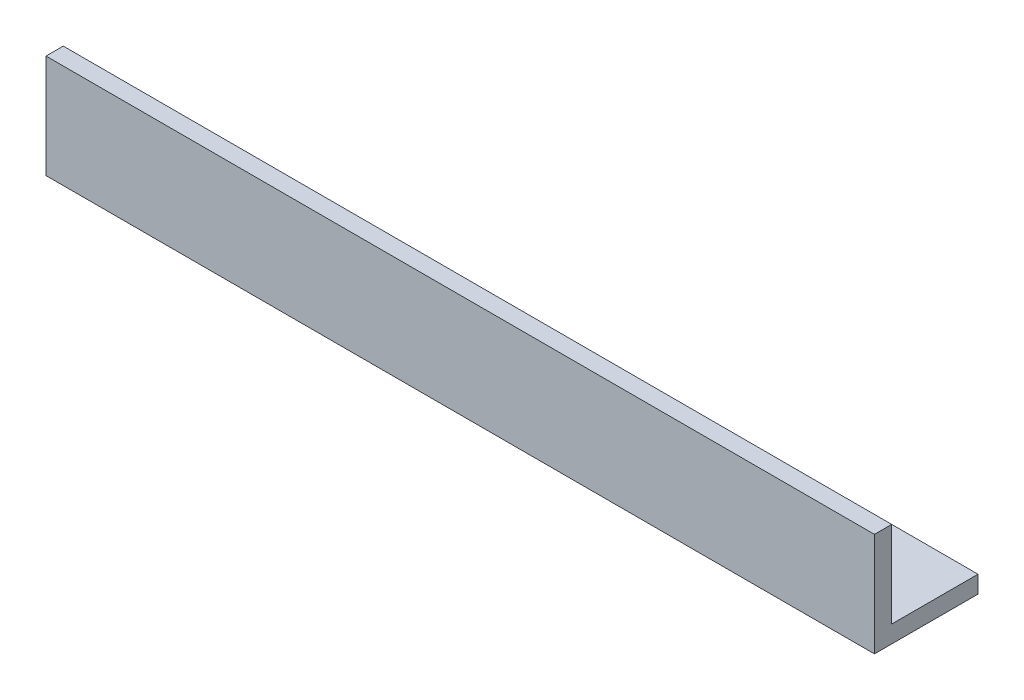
ISO-10303-21;
HEADER;
FILE_DESCRIPTION(('STEP AP214'),'2;1');
FILE_NAME('part.step','',(''),(''),'','','');
FILE_SCHEMA(('AUTOMOTIVE_DESIGN { 1 0 10303 214 1 1 1 1 }'));
ENDSEC;
DATA;
#1=APPLICATION_CONTEXT('core data for automotive mechanical design processes');
#2=APPLICATION_PROTOCOL_DEFINITION('international standard','automotive_design',2000,#1);
#3=PRODUCT_CONTEXT('',#1,'mechanical');
#4=PRODUCT('Part','Part','',(#3));
#5=PRODUCT_RELATED_PRODUCT_CATEGORY('part','',(#4));
#6=PRODUCT_DEFINITION_FORMATION('','',#4);
#7=PRODUCT_DEFINITION_CONTEXT('part definition',#1,'design');
#8=PRODUCT_DEFINITION('design','',#6,#7);
#9=PRODUCT_DEFINITION_SHAPE('','',#8);
#10=(LENGTH_UNIT() NAMED_UNIT(*) SI_UNIT(.MILLI.,.METRE.));
#11=(NAMED_UNIT(*) PLANE_ANGLE_UNIT() SI_UNIT($,.RADIAN.));
#12=(NAMED_UNIT(*) SI_UNIT($,.STERADIAN.) SOLID_ANGLE_UNIT());
#13=UNCERTAINTY_MEASURE_WITH_UNIT(LENGTH_MEASURE(1.E-05),#10,'distance_accuracy_value','');
#14=(GEOMETRIC_REPRESENTATION_CONTEXT(3) GLOBAL_UNCERTAINTY_ASSIGNED_CONTEXT((#13)) GLOBAL_UNIT_ASSIGNED_CONTEXT((#10,
#11,#12)) REPRESENTATION_CONTEXT('',''));
#15=CARTESIAN_POINT('',(0.,0.,0.));
#16=DIRECTION('',(0.,0.,1.));
#17=DIRECTION('',(1.,0.,0.));
#18=AXIS2_PLACEMENT_3D('',#15,#16,#17);
#19=CARTESIAN_POINT('',(304.8,0.,0.));
#20=DIRECTION('',(0.,1.,0.));
#21=DIRECTION('',(0.,0.,1.));
#22=AXIS2_PLACEMENT_3D('',#19,#20,#21);
#23=PLANE('',#22);
#24=DIRECTION('',(0.,0.,-1.));
#25=VECTOR('',#24,1.);
#26=CARTESIAN_POINT('',(0.,0.,0.));
#27=LINE('',#26,#25);
#28=CARTESIAN_POINT('',(0.,0.,0.));
#29=VERTEX_POINT('',#28);
#30=CARTESIAN_POINT('',(0.,0.,-38.1));
#31=VERTEX_POINT('',#30);
#32=EDGE_CURVE('E117',#29,#31,#27,.T.);
#33=ORIENTED_EDGE('',*,*,#32,.T.);
#34=DIRECTION('',(-1.,0.,0.));
#35=VECTOR('',#34,1.);
#36=CARTESIAN_POINT('',(304.8,0.,-38.1));
#37=LINE('',#36,#35);
#38=CARTESIAN_POINT('',(304.8,0.,-38.1));
#39=VERTEX_POINT('',#38);
#40=EDGE_CURVE('E11',#39,#31,#37,.T.);
#41=ORIENTED_EDGE('',*,*,#40,.F.);
#42=DIRECTION('',(0.,0.,-1.));
#43=VECTOR('',#42,1.);
#44=CARTESIAN_POINT('',(304.8,0.,0.));
#45=LINE('',#44,#43);
#46=CARTESIAN_POINT('',(304.8,0.,0.));
#47=VERTEX_POINT('',#46);
#48=EDGE_CURVE('E127',#47,#39,#45,.T.);
#49=ORIENTED_EDGE('',*,*,#48,.F.);
#50=DIRECTION('',(-1.,0.,0.));
#51=VECTOR('',#50,1.);
#52=CARTESIAN_POINT('',(304.8,0.,0.));
#53=LINE('',#52,#51);
#54=EDGE_CURVE('E113',#47,#29,#53,.T.);
#55=ORIENTED_EDGE('',*,*,#54,.T.);
#56=EDGE_LOOP('',(#33,#41,#49,#55));
#57=FACE_BOUND('',#56,.T.);
#58=ADVANCED_FACE('F33',(#57),#23,.F.);
#59=CARTESIAN_POINT('',(304.8,0.,-38.1));
#60=DIRECTION('',(0.,0.,1.));
#61=DIRECTION('',(1.,0.,0.));
#62=AXIS2_PLACEMENT_3D('',#59,#60,#61);
#63=PLANE('',#62);
#64=DIRECTION('',(0.,1.,0.));
#65=VECTOR('',#64,1.);
#66=CARTESIAN_POINT('',(0.,0.,-38.1));
#67=LINE('',#66,#65);
#68=CARTESIAN_POINT('',(0.,6.35,-38.1));
#69=VERTEX_POINT('',#68);
#70=EDGE_CURVE('E120',#31,#69,#67,.T.);
#71=ORIENTED_EDGE('',*,*,#70,.T.);
#72=DIRECTION('',(-1.,0.,0.));
#73=VECTOR('',#72,1.);
#74=CARTESIAN_POINT('',(304.8,6.35,-38.1));
#75=LINE('',#74,#73);
#76=CARTESIAN_POINT('',(304.8,6.35,-38.1));
#77=VERTEX_POINT('',#76);
#78=EDGE_CURVE('E41',#77,#69,#75,.T.);
#79=ORIENTED_EDGE('',*,*,#78,.F.);
#80=DIRECTION('',(0.,1.,0.));
#81=VECTOR('',#80,1.);
#82=CARTESIAN_POINT('',(304.8,0.,-38.1));
#83=LINE('',#82,#81);
#84=EDGE_CURVE('E86',#39,#77,#83,.T.);
#85=ORIENTED_EDGE('',*,*,#84,.F.);
#86=ORIENTED_EDGE('',*,*,#40,.T.);
#87=EDGE_LOOP('',(#71,#79,#85,#86));
#88=FACE_BOUND('',#87,.T.);
#89=ADVANCED_FACE('F151',(#88),#63,.F.);
#90=CARTESIAN_POINT('',(304.8,6.35,-38.1));
#91=DIRECTION('',(0.,-1.,0.));
#92=DIRECTION('',(0.,0.,-1.));
#93=AXIS2_PLACEMENT_3D('',#90,#91,#92);
#94=PLANE('',#93);
#95=DIRECTION('',(0.,0.,1.));
#96=VECTOR('',#95,1.);
#97=CARTESIAN_POINT('',(0.,6.35,-38.1));
#98=LINE('',#97,#96);
#99=CARTESIAN_POINT('',(0.,6.35,-6.35000000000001));
#100=VERTEX_POINT('',#99);
#101=EDGE_CURVE('E122',#69,#100,#98,.T.);
#102=ORIENTED_EDGE('',*,*,#101,.T.);
#103=DIRECTION('',(-1.,0.,0.));
#104=VECTOR('',#103,1.);
#105=CARTESIAN_POINT('',(304.8,6.35,-6.35000000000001));
#106=LINE('',#105,#104);
#107=CARTESIAN_POINT('',(304.8,6.35,-6.35000000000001));
#108=VERTEX_POINT('',#107);
#109=EDGE_CURVE('E108',#108,#100,#106,.T.);
#110=ORIENTED_EDGE('',*,*,#109,.F.);
#111=DIRECTION('',(0.,0.,1.));
#112=VECTOR('',#111,1.);
#113=CARTESIAN_POINT('',(304.8,6.35,-38.1));
#114=LINE('',#113,#112);
#115=EDGE_CURVE('E99',#77,#108,#114,.T.);
#116=ORIENTED_EDGE('',*,*,#115,.F.);
#117=ORIENTED_EDGE('',*,*,#78,.T.);
#118=EDGE_LOOP('',(#102,#110,#116,#117));
#119=FACE_BOUND('',#118,.T.);
#120=ADVANCED_FACE('F133',(#119),#94,.F.);
#121=CARTESIAN_POINT('',(304.8,38.1,-6.35));
#122=DIRECTION('',(0.,0.,1.));
#123=DIRECTION('',(0.,-1.,0.));
#124=AXIS2_PLACEMENT_3D('',#121,#122,#123);
#125=PLANE('',#124);
#126=DIRECTION('',(0.,1.,0.));
#127=VECTOR('',#126,1.);
#128=CARTESIAN_POINT('',(0.,38.1,-6.35));
#129=LINE('',#128,#127);
#130=CARTESIAN_POINT('',(0.,38.1,-6.35));
#131=VERTEX_POINT('',#130);
#132=EDGE_CURVE('E107',#100,#131,#129,.T.);
#133=ORIENTED_EDGE('',*,*,#132,.T.);
#134=DIRECTION('',(-1.,0.,0.));
#135=VECTOR('',#134,1.);
#136=CARTESIAN_POINT('',(304.8,38.1,-6.35));
#137=LINE('',#136,#135);
#138=CARTESIAN_POINT('',(304.8,38.1,-6.35));
#139=VERTEX_POINT('',#138);
#140=EDGE_CURVE('E104',#139,#131,#137,.T.);
#141=ORIENTED_EDGE('',*,*,#140,.F.);
#142=DIRECTION('',(0.,1.,0.));
#143=VECTOR('',#142,1.);
#144=CARTESIAN_POINT('',(304.8,38.1,-6.35));
#145=LINE('',#144,#143);
#146=EDGE_CURVE('E93',#108,#139,#145,.T.);
#147=ORIENTED_EDGE('',*,*,#146,.F.);
#148=ORIENTED_EDGE('',*,*,#109,.T.);
#149=EDGE_LOOP('',(#133,#141,#147,#148));
#150=FACE_BOUND('',#149,.T.);
#151=ADVANCED_FACE('F105',(#150),#125,.F.);
#152=CARTESIAN_POINT('',(304.8,38.1,0.));
#153=DIRECTION('',(0.,-1.,0.));
#154=DIRECTION('',(0.,0.,-1.));
#155=AXIS2_PLACEMENT_3D('',#152,#153,#154);
#156=PLANE('',#155);
#157=DIRECTION('',(0.,0.,1.));
#158=VECTOR('',#157,1.);
#159=CARTESIAN_POINT('',(0.,38.1,0.));
#160=LINE('',#159,#158);
#161=CARTESIAN_POINT('',(0.,38.1,0.));
#162=VERTEX_POINT('',#161);
#163=EDGE_CURVE('E72',#131,#162,#160,.T.);
#164=ORIENTED_EDGE('',*,*,#163,.T.);
#165=DIRECTION('',(-1.,0.,0.));
#166=VECTOR('',#165,1.);
#167=CARTESIAN_POINT('',(304.8,38.1,0.));
#168=LINE('',#167,#166);
#169=CARTESIAN_POINT('',(304.8,38.1,0.));
#170=VERTEX_POINT('',#169);
#171=EDGE_CURVE('E109',#170,#162,#168,.T.);
#172=ORIENTED_EDGE('',*,*,#171,.F.);
#173=DIRECTION('',(0.,0.,1.));
#174=VECTOR('',#173,1.);
#175=CARTESIAN_POINT('',(304.8,38.1,0.));
#176=LINE('',#175,#174);
#177=EDGE_CURVE('E97',#139,#170,#176,.T.);
#178=ORIENTED_EDGE('',*,*,#177,.F.);
#179=ORIENTED_EDGE('',*,*,#140,.T.);
#180=EDGE_LOOP('',(#164,#172,#178,#179));
#181=FACE_BOUND('',#180,.T.);
#182=ADVANCED_FACE('F111',(#181),#156,.F.);
#183=CARTESIAN_POINT('',(304.8,0.,0.));
#184=DIRECTION('',(0.,0.,-1.));
#185=DIRECTION('',(-1.,0.,0.));
#186=AXIS2_PLACEMENT_3D('',#183,#184,#185);
#187=PLANE('',#186);
#188=DIRECTION('',(0.,-1.,0.));
#189=VECTOR('',#188,1.);
#190=CARTESIAN_POINT('',(0.,0.,0.));
#191=LINE('',#190,#189);
#192=EDGE_CURVE('E78',#162,#29,#191,.T.);
#193=ORIENTED_EDGE('',*,*,#192,.T.);
#194=ORIENTED_EDGE('',*,*,#54,.F.);
#195=DIRECTION('',(0.,-1.,0.));
#196=VECTOR('',#195,1.);
#197=CARTESIAN_POINT('',(304.8,0.,0.));
#198=LINE('',#197,#196);
#199=EDGE_CURVE('E49',#170,#47,#198,.T.);
#200=ORIENTED_EDGE('',*,*,#199,.F.);
#201=ORIENTED_EDGE('',*,*,#171,.T.);
#202=EDGE_LOOP('',(#193,#194,#200,#201));
#203=FACE_BOUND('',#202,.T.);
#204=ADVANCED_FACE('F140',(#203),#187,.F.);
#205=CARTESIAN_POINT('',(304.8,0.,0.));
#206=DIRECTION('',(1.,0.,0.));
#207=DIRECTION('',(0.,0.,-1.));
#208=AXIS2_PLACEMENT_3D('',#205,#206,#207);
#209=PLANE('',#208);
#210=ORIENTED_EDGE('',*,*,#48,.T.);
#211=ORIENTED_EDGE('',*,*,#84,.T.);
#212=ORIENTED_EDGE('',*,*,#115,.T.);
#213=ORIENTED_EDGE('',*,*,#146,.T.);
#214=ORIENTED_EDGE('',*,*,#177,.T.);
#215=ORIENTED_EDGE('',*,*,#199,.T.);
#216=EDGE_LOOP('',(#210,#211,#212,#213,#214,#215));
#217=FACE_BOUND('',#216,.T.);
#218=ADVANCED_FACE('F95',(#217),#209,.T.);
#219=CARTESIAN_POINT('',(0.,0.,0.));
#220=DIRECTION('',(1.,0.,0.));
#221=DIRECTION('',(0.,0.,-1.));
#222=AXIS2_PLACEMENT_3D('',#219,#220,#221);
#223=PLANE('',#222);
#224=ORIENTED_EDGE('',*,*,#32,.F.);
#225=ORIENTED_EDGE('',*,*,#192,.F.);
#226=ORIENTED_EDGE('',*,*,#163,.F.);
#227=ORIENTED_EDGE('',*,*,#132,.F.);
#228=ORIENTED_EDGE('',*,*,#101,.F.);
#229=ORIENTED_EDGE('',*,*,#70,.F.);
#230=EDGE_LOOP('',(#224,#225,#226,#227,#228,#229));
#231=FACE_BOUND('',#230,.T.);
#232=ADVANCED_FACE('F136',(#231),#223,.F.);
#233=CLOSED_SHELL('',(#58,#89,#120,#151,#182,#204,#218,#232));
#234=MANIFOLD_SOLID_BREP('B2',#233);
#235=ADVANCED_BREP_SHAPE_REPRESENTATION('',(#18,#234),#14);
#236=SHAPE_DEFINITION_REPRESENTATION(#9,#235);
ENDSEC;
END-ISO-10303-21;
